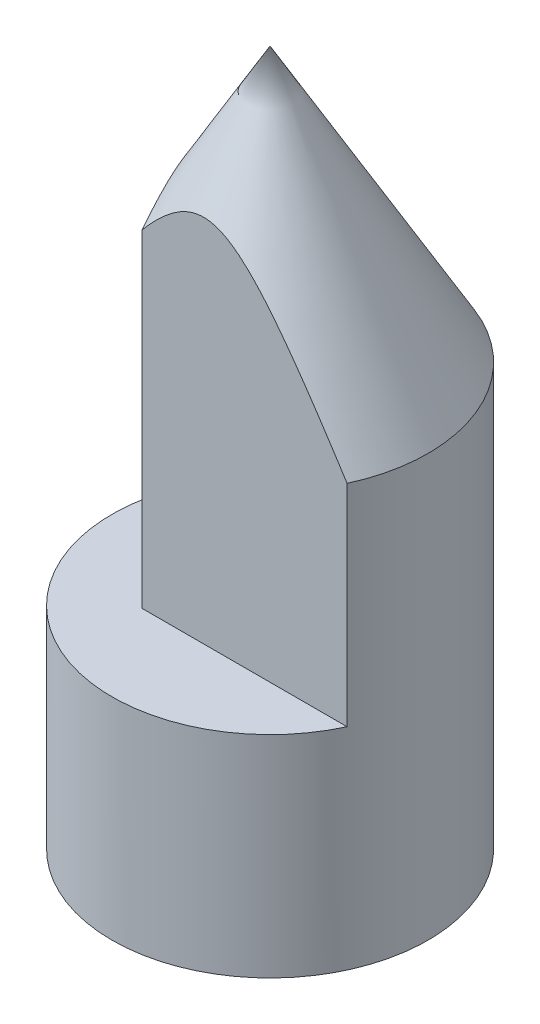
from build123d import *

# Parameters (mm, degrees)
SKETCH_1_R          = 15
EXTRUDE_1_DEPTH     = 40
SKETCH_3_W          = 35.658986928
SKETCH_3_H          = 9
SKETCH_3_W_2        = 18.147487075
SKETCH_3_H_2        = 28.610149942
CUT_EXTRUDE_2_DEPTH = 48


with BuildPart() as part:
    # Sketch 1 → Extrude 1 (new body)
    with BuildSketch(Plane(origin=(0, 0, 0), x_dir=(1, 0, 0), z_dir=(0, 1, 0))):
        with Locations(Location((0, 0, 0), (0, 0, 270))):
            Circle(SKETCH_1_R)
    extrude(amount=EXTRUDE_1_DEPTH)

    # Sketch 2 → Revolve 1 (revolve)
    with BuildSketch(Plane.XY, mode=Mode.PRIVATE) as revolve_1_sk:
        Polygon((0, 65.980762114), (-15, 40), (0, 40), align=None)
    revolve(revolve_1_sk.sketch.rotate(Axis((0, 0, 0), (0, 1, 0)), 270), axis=Axis((0, 0, 0), (0, 1, 0)))

    # Sketch 3 → Cut-Extrude 2 (cut)
    with BuildSketch(Plane(origin=(0, 20, 0), x_dir=(-1, 0, 0), z_dir=(0, 1, 0))):
        with Locations((-4.793161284, 10.803137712)):
            Rectangle(SKETCH_3_W, SKETCH_3_H)
        with Locations((14.924488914, 0.729527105)):
            Rectangle(SKETCH_3_W_2, SKETCH_3_H_2)
    extrude(amount=CUT_EXTRUDE_2_DEPTH, mode=Mode.SUBTRACT)


solid = part.part
